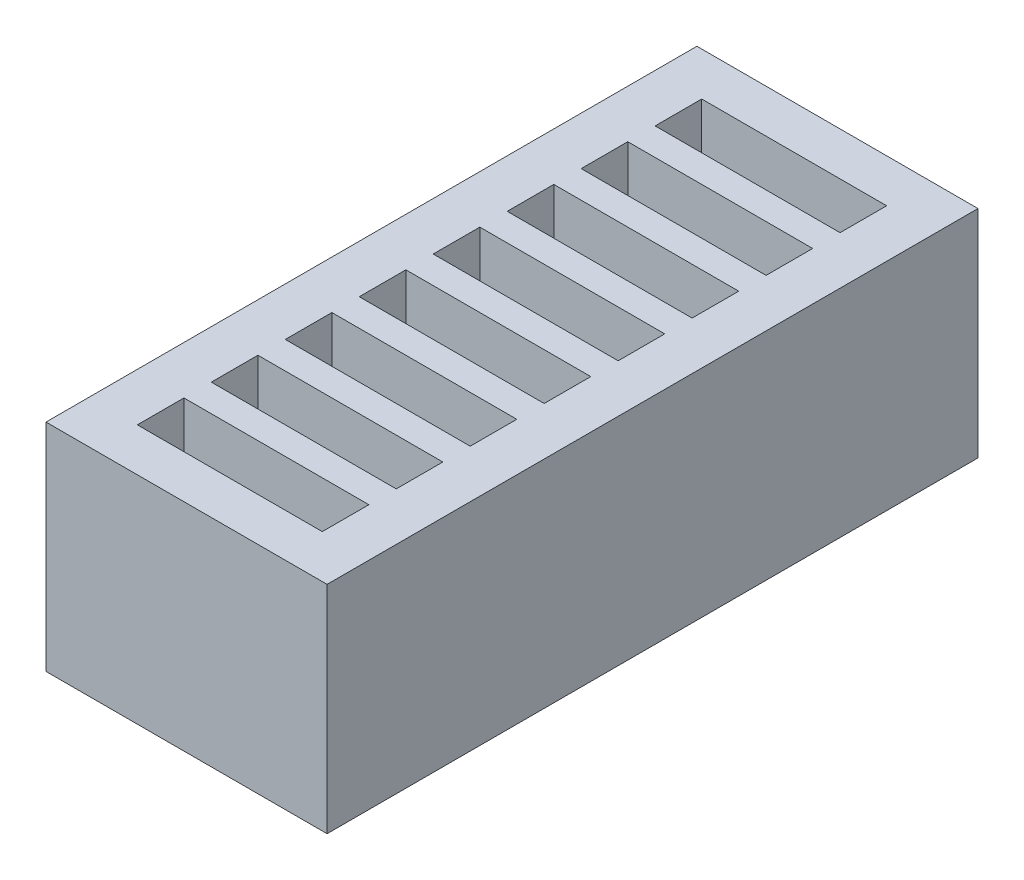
from build123d import *

# Parameters (mm, degrees)
SKETCH1_W          = 9.652
SKETCH1_H          = 22.352
EXTRUDE1_DEPTH     = 7.4168
SKETCH2_W          = 6.35
SKETCH2_H          = 1.6002
CUT_EXTRUDE1_DEPTH = 1.6002


with BuildPart() as part:
    # Sketch1 → Extrude1 (new body)
    with BuildSketch(Plane(origin=(0, 0, 0), x_dir=(1, 0, 0), z_dir=(0, 1, 0))):
        with Locations((4.826, 11.176)):
            Rectangle(SKETCH1_W, SKETCH1_H)
    extrude(amount=EXTRUDE1_DEPTH)

    # Sketch2 → Cut-Extrude1 (cut)
    with BuildSketch(Plane(origin=(0, 7.4168, 0), x_dir=(-1, 0, 0), z_dir=(0, 1, 0))):
        with Locations((-4.826, -7.366)):
            Rectangle(SKETCH2_W, SKETCH2_H)
        with Locations((-4.826, -9.906)):
            Rectangle(SKETCH2_W, SKETCH2_H)
        with Locations((-4.826, -4.826)):
            Rectangle(SKETCH2_W, SKETCH2_H)
        with Locations((-4.826, -2.286)):
            Rectangle(SKETCH2_W, SKETCH2_H)
        with Locations((-4.826, -20.066)):
            Rectangle(SKETCH2_W, SKETCH2_H)
        with Locations((-4.826, -17.526)):
            Rectangle(SKETCH2_W, SKETCH2_H)
        with Locations((-4.826, -14.986)):
            Rectangle(SKETCH2_W, SKETCH2_H)
        with Locations((-4.826, -12.446)):
            Rectangle(SKETCH2_W, SKETCH2_H)
    extrude(amount=-CUT_EXTRUDE1_DEPTH, mode=Mode.SUBTRACT)


solid = part.part
